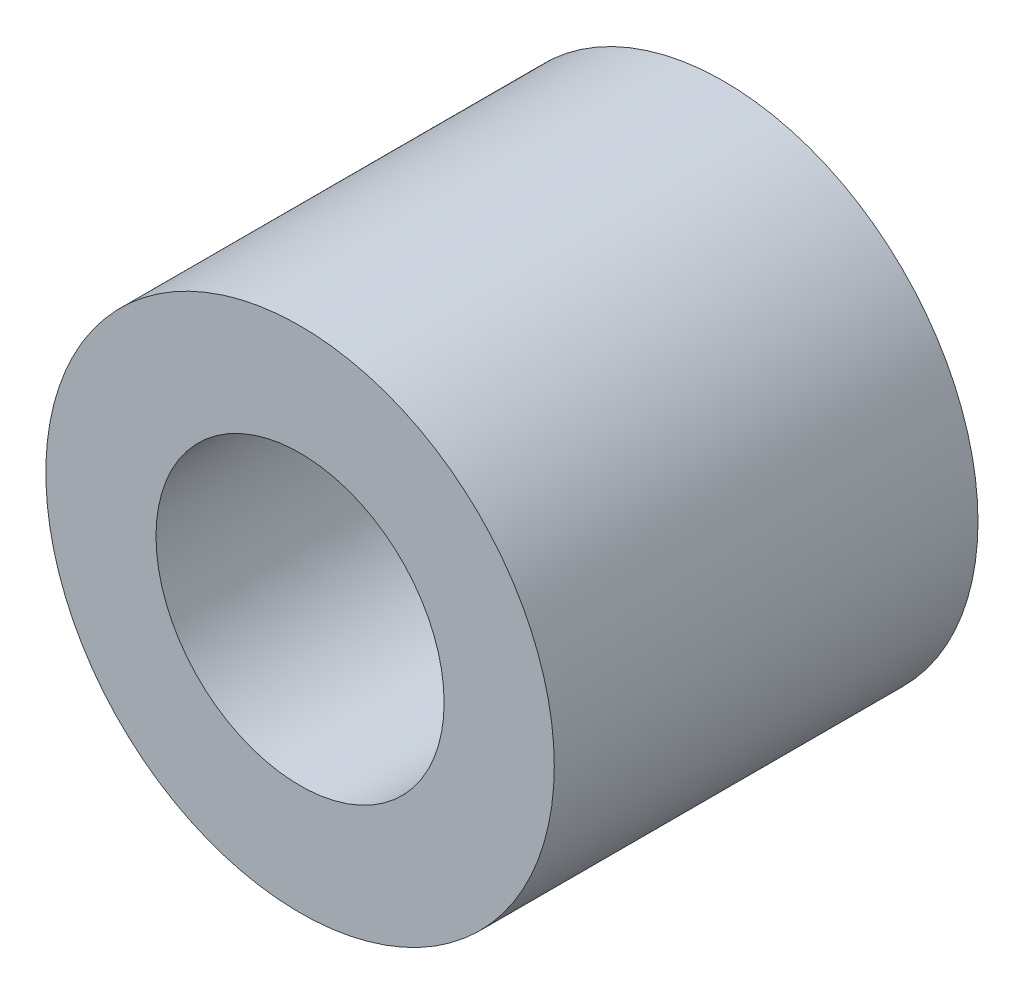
ISO-10303-21;
HEADER;
FILE_DESCRIPTION(('STEP AP214'),'2;1');
FILE_NAME('part.step','',(''),(''),'','','');
FILE_SCHEMA(('AUTOMOTIVE_DESIGN { 1 0 10303 214 1 1 1 1 }'));
ENDSEC;
DATA;
#1=APPLICATION_CONTEXT('core data for automotive mechanical design processes');
#2=APPLICATION_PROTOCOL_DEFINITION('international standard','automotive_design',2000,#1);
#3=PRODUCT_CONTEXT('',#1,'mechanical');
#4=PRODUCT('Part','Part','',(#3));
#5=PRODUCT_RELATED_PRODUCT_CATEGORY('part','',(#4));
#6=PRODUCT_DEFINITION_FORMATION('','',#4);
#7=PRODUCT_DEFINITION_CONTEXT('part definition',#1,'design');
#8=PRODUCT_DEFINITION('design','',#6,#7);
#9=PRODUCT_DEFINITION_SHAPE('','',#8);
#10=(LENGTH_UNIT() NAMED_UNIT(*) SI_UNIT(.MILLI.,.METRE.));
#11=(NAMED_UNIT(*) PLANE_ANGLE_UNIT() SI_UNIT($,.RADIAN.));
#12=(NAMED_UNIT(*) SI_UNIT($,.STERADIAN.) SOLID_ANGLE_UNIT());
#13=UNCERTAINTY_MEASURE_WITH_UNIT(LENGTH_MEASURE(1.E-05),#10,'distance_accuracy_value','');
#14=(GEOMETRIC_REPRESENTATION_CONTEXT(3) GLOBAL_UNCERTAINTY_ASSIGNED_CONTEXT((#13)) GLOBAL_UNIT_ASSIGNED_CONTEXT((#10,
#11,#12)) REPRESENTATION_CONTEXT('',''));
#15=CARTESIAN_POINT('',(0.,0.,0.));
#16=DIRECTION('',(0.,0.,1.));
#17=DIRECTION('',(1.,0.,0.));
#18=AXIS2_PLACEMENT_3D('',#15,#16,#17);
#19=CARTESIAN_POINT('',(0.,0.,5.));
#20=DIRECTION('',(0.,0.,1.));
#21=DIRECTION('',(1.,0.,0.));
#22=AXIS2_PLACEMENT_3D('',#19,#20,#21);
#23=PLANE('',#22);
#24=CARTESIAN_POINT('',(0.,0.,5.));
#25=DIRECTION('',(0.,0.,1.));
#26=DIRECTION('',(1.,0.,0.));
#27=AXIS2_PLACEMENT_3D('',#24,#25,#26);
#28=CIRCLE('',#27,3.);
#29=CARTESIAN_POINT('',(3.,0.,5.));
#30=VERTEX_POINT('',#29);
#31=EDGE_CURVE('E10',#30,#30,#28,.T.);
#32=ORIENTED_EDGE('',*,*,#31,.T.);
#33=EDGE_LOOP('',(#32));
#34=FACE_BOUND('',#33,.T.);
#35=CARTESIAN_POINT('',(0.,0.,5.));
#36=DIRECTION('',(0.,0.,1.));
#37=DIRECTION('',(1.,0.,0.));
#38=AXIS2_PLACEMENT_3D('',#35,#36,#37);
#39=CIRCLE('',#38,1.7);
#40=CARTESIAN_POINT('',(1.7,0.,5.));
#41=VERTEX_POINT('',#40);
#42=EDGE_CURVE('E52',#41,#41,#39,.T.);
#43=ORIENTED_EDGE('',*,*,#42,.F.);
#44=EDGE_LOOP('',(#43));
#45=FACE_BOUND('',#44,.T.);
#46=ADVANCED_FACE('F41',(#34,#45),#23,.T.);
#47=CARTESIAN_POINT('',(0.,0.,0.));
#48=DIRECTION('',(0.,0.,1.));
#49=DIRECTION('',(1.,0.,0.));
#50=AXIS2_PLACEMENT_3D('',#47,#48,#49);
#51=PLANE('',#50);
#52=CARTESIAN_POINT('',(0.,0.,0.));
#53=DIRECTION('',(0.,0.,1.));
#54=DIRECTION('',(1.,0.,0.));
#55=AXIS2_PLACEMENT_3D('',#52,#53,#54);
#56=CIRCLE('',#55,3.);
#57=CARTESIAN_POINT('',(3.,0.,0.));
#58=VERTEX_POINT('',#57);
#59=EDGE_CURVE('E45',#58,#58,#56,.T.);
#60=ORIENTED_EDGE('',*,*,#59,.F.);
#61=EDGE_LOOP('',(#60));
#62=FACE_BOUND('',#61,.T.);
#63=CARTESIAN_POINT('',(0.,0.,0.));
#64=DIRECTION('',(0.,0.,1.));
#65=DIRECTION('',(1.,0.,0.));
#66=AXIS2_PLACEMENT_3D('',#63,#64,#65);
#67=CIRCLE('',#66,1.7);
#68=CARTESIAN_POINT('',(1.7,0.,0.));
#69=VERTEX_POINT('',#68);
#70=EDGE_CURVE('E54',#69,#69,#67,.T.);
#71=ORIENTED_EDGE('',*,*,#70,.T.);
#72=EDGE_LOOP('',(#71));
#73=FACE_BOUND('',#72,.T.);
#74=ADVANCED_FACE('F64',(#62,#73),#51,.F.);
#75=CARTESIAN_POINT('',(0.,0.,5.));
#76=DIRECTION('',(0.,0.,-1.));
#77=DIRECTION('',(-1.,0.,0.));
#78=AXIS2_PLACEMENT_3D('',#75,#76,#77);
#79=CYLINDRICAL_SURFACE('',#78,3.);
#80=ORIENTED_EDGE('',*,*,#31,.F.);
#81=EDGE_LOOP('',(#80));
#82=FACE_BOUND('',#81,.T.);
#83=ORIENTED_EDGE('',*,*,#59,.T.);
#84=EDGE_LOOP('',(#83));
#85=FACE_BOUND('',#84,.T.);
#86=ADVANCED_FACE('F43',(#82,#85),#79,.T.);
#87=CARTESIAN_POINT('',(0.,0.,5.));
#88=DIRECTION('',(0.,0.,-1.));
#89=DIRECTION('',(-1.,0.,0.));
#90=AXIS2_PLACEMENT_3D('',#87,#88,#89);
#91=CYLINDRICAL_SURFACE('',#90,1.7);
#92=ORIENTED_EDGE('',*,*,#42,.T.);
#93=EDGE_LOOP('',(#92));
#94=FACE_BOUND('',#93,.T.);
#95=ORIENTED_EDGE('',*,*,#70,.F.);
#96=EDGE_LOOP('',(#95));
#97=FACE_BOUND('',#96,.T.);
#98=ADVANCED_FACE('F60',(#94,#97),#91,.F.);
#99=CLOSED_SHELL('',(#46,#74,#86,#98));
#100=MANIFOLD_SOLID_BREP('B2',#99);
#101=ADVANCED_BREP_SHAPE_REPRESENTATION('',(#18,#100),#14);
#102=SHAPE_DEFINITION_REPRESENTATION(#9,#101);
ENDSEC;
END-ISO-10303-21;
